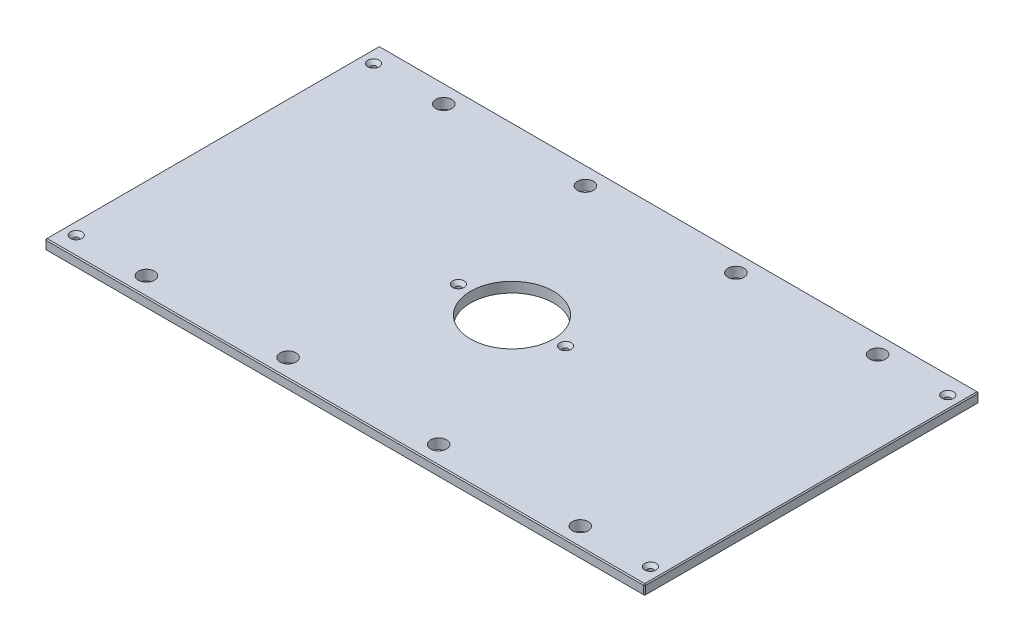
from build123d import *

# Parameters (mm, degrees)
SKETCH1_W                                        = 746.125
SKETCH1_H                                        = 415.925
BOSS_EXTRUDE1_DEPTH                              = 12.7
SKETCH13_R                                       = 51.562
CUT_EXTRUDE6_DEPTH                               = 428.30003547
F_25_32_0_78125_DIAMETER_HOLE1_D                 = 19.84375
CHAMFER2_SIZE                                    = 1.27
CSK_FOR_1_4_FLAT_HEAD_MACHINE_SCREW1_D           = 6.7564
CSK_FOR_1_4_FLAT_HEAD_MACHINE_SCREW1_CSINK_D     = 14.2748
CSK_FOR_1_4_FLAT_HEAD_MACHINE_SCREW1_CSINK_ANGLE = 82


with BuildPart() as part:
    # Sketch1 → Boss-Extrude1 (new body)
    with BuildSketch(Plane(origin=(0, 0, 0), x_dir=(1, 0, 0), z_dir=(0, 1, 0))):
        Rectangle(SKETCH1_W, SKETCH1_H)
    extrude(amount=BOSS_EXTRUDE1_DEPTH)

    # Sketch13 → Cut-Extrude6 (cut, through all)
    with BuildSketch(Plane(origin=(0, 12.7, 0), x_dir=(1, 0, 0), z_dir=(0, 1, 0))):
        with Locations(Location((0, 0, 0), (0, 0, 270))):
            Circle(SKETCH13_R)
    extrude(amount=-CUT_EXTRUDE6_DEPTH, mode=Mode.SUBTRACT)

    # 25_32 _0.78125_ Diameter Hole1 (through all)
    with Locations(Plane(origin=(0, 12.7, 0), x_dir=(1, 0, 0), z_dir=(0, 1, 0))):
        with Locations((269.875, 184.94248), (-269.875, 184.94248), (269.875, -184.94248), (-269.875, -184.94248), (-93.6625, 184.94248), (93.6625, 184.94248), (93.6625, -184.94248), (-93.6625, -184.94248)):
            Hole(F_25_32_0_78125_DIAMETER_HOLE1_D / 2)

    # Chamfer2
    chamfer2_edges = [part.edges().sort_by_distance(p)[0] for p in [
        (373.0625, 12.7, 0),
        (0, 12.7, -207.9625),
        (-373.0625, 12.7, 0),
        (0, 0, -207.9625),
        (373.0625, 0, 0),
        (0, 0, 207.9625),
        (-373.0625, 0, 0),
        (0, 12.7, 207.9625),
        (-373.0625, 6.35, -207.9625),
        (373.0625, 6.35, -207.9625),
        (373.0625, 6.35, 207.9625),
        (-373.0625, 6.35, 207.9625),
    ]]
    chamfer(chamfer2_edges, length=CHAMFER2_SIZE)

    # CSK for 1_4 Flat Head Machine Screw1 (through all)
    with Locations(Plane(origin=(0, 12.7, 0), x_dir=(1, 0, 0), z_dir=(0, 1, 0))):
        with Locations((357.1875, 184.94248), (357.1875, -184.94248), (-357.1875, -184.94248), (-66.675, 0), (66.675, 0), (-357.1875, 184.94248), (-269.875, 184.94248), (-269.875, -184.94248)):
            CounterSinkHole(CSK_FOR_1_4_FLAT_HEAD_MACHINE_SCREW1_D / 2, CSK_FOR_1_4_FLAT_HEAD_MACHINE_SCREW1_CSINK_D / 2, counter_sink_angle=CSK_FOR_1_4_FLAT_HEAD_MACHINE_SCREW1_CSINK_ANGLE)


solid = part.part
